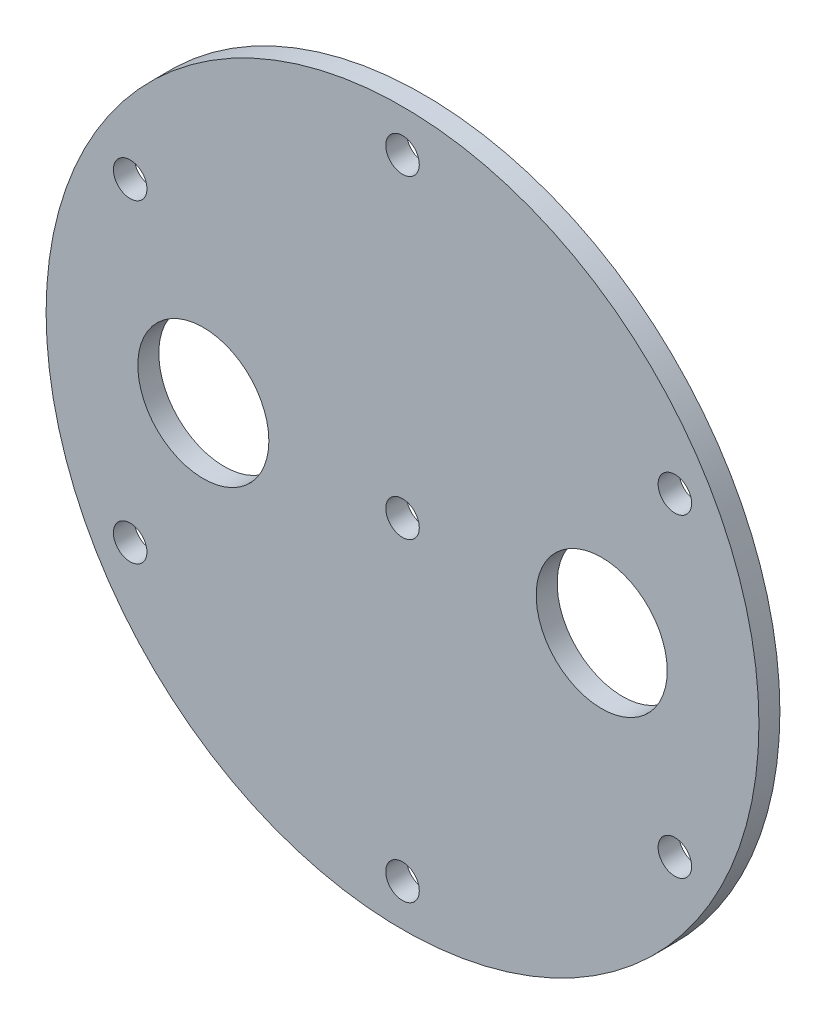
ISO-10303-21;
HEADER;
FILE_DESCRIPTION(('STEP AP214'),'2;1');
FILE_NAME('part.step','',(''),(''),'','','');
FILE_SCHEMA(('AUTOMOTIVE_DESIGN { 1 0 10303 214 1 1 1 1 }'));
ENDSEC;
DATA;
#1=APPLICATION_CONTEXT('core data for automotive mechanical design processes');
#2=APPLICATION_PROTOCOL_DEFINITION('international standard','automotive_design',2000,#1);
#3=PRODUCT_CONTEXT('',#1,'mechanical');
#4=PRODUCT('Part','Part','',(#3));
#5=PRODUCT_RELATED_PRODUCT_CATEGORY('part','',(#4));
#6=PRODUCT_DEFINITION_FORMATION('','',#4);
#7=PRODUCT_DEFINITION_CONTEXT('part definition',#1,'design');
#8=PRODUCT_DEFINITION('design','',#6,#7);
#9=PRODUCT_DEFINITION_SHAPE('','',#8);
#10=(LENGTH_UNIT() NAMED_UNIT(*) SI_UNIT(.MILLI.,.METRE.));
#11=(NAMED_UNIT(*) PLANE_ANGLE_UNIT() SI_UNIT($,.RADIAN.));
#12=(NAMED_UNIT(*) SI_UNIT($,.STERADIAN.) SOLID_ANGLE_UNIT());
#13=UNCERTAINTY_MEASURE_WITH_UNIT(LENGTH_MEASURE(1.E-05),#10,'distance_accuracy_value','');
#14=(GEOMETRIC_REPRESENTATION_CONTEXT(3) GLOBAL_UNCERTAINTY_ASSIGNED_CONTEXT((#13)) GLOBAL_UNIT_ASSIGNED_CONTEXT((#10,
#11,#12)) REPRESENTATION_CONTEXT('',''));
#15=CARTESIAN_POINT('',(0.,0.,0.));
#16=DIRECTION('',(0.,0.,1.));
#17=DIRECTION('',(1.,0.,0.));
#18=AXIS2_PLACEMENT_3D('',#15,#16,#17);
#19=CARTESIAN_POINT('',(0.,0.,-2.));
#20=DIRECTION('',(0.,0.,1.));
#21=DIRECTION('',(1.,0.,0.));
#22=AXIS2_PLACEMENT_3D('',#19,#20,#21);
#23=CYLINDRICAL_SURFACE('',#22,34.);
#24=CARTESIAN_POINT('',(0.,0.,-2.));
#25=DIRECTION('',(0.,0.,1.));
#26=DIRECTION('',(1.,0.,0.));
#27=AXIS2_PLACEMENT_3D('',#24,#25,#26);
#28=CIRCLE('',#27,34.);
#29=CARTESIAN_POINT('',(34.,0.,-2.));
#30=VERTEX_POINT('',#29);
#31=EDGE_CURVE('E10',#30,#30,#28,.T.);
#32=ORIENTED_EDGE('',*,*,#31,.T.);
#33=EDGE_LOOP('',(#32));
#34=FACE_BOUND('',#33,.T.);
#35=CARTESIAN_POINT('',(0.,0.,0.));
#36=DIRECTION('',(0.,0.,1.));
#37=DIRECTION('',(1.,0.,0.));
#38=AXIS2_PLACEMENT_3D('',#35,#36,#37);
#39=CIRCLE('',#38,34.);
#40=CARTESIAN_POINT('',(34.,0.,0.));
#41=VERTEX_POINT('',#40);
#42=EDGE_CURVE('E35',#41,#41,#39,.T.);
#43=ORIENTED_EDGE('',*,*,#42,.F.);
#44=EDGE_LOOP('',(#43));
#45=FACE_BOUND('',#44,.T.);
#46=ADVANCED_FACE('F32',(#34,#45),#23,.T.);
#47=CARTESIAN_POINT('',(0.,0.,-2.));
#48=DIRECTION('',(0.,0.,1.));
#49=DIRECTION('',(1.,0.,0.));
#50=AXIS2_PLACEMENT_3D('',#47,#48,#49);
#51=PLANE('',#50);
#52=CARTESIAN_POINT('',(19.,0.,-2.));
#53=DIRECTION('',(0.,0.,1.));
#54=DIRECTION('',(1.,0.,0.));
#55=AXIS2_PLACEMENT_3D('',#52,#53,#54);
#56=CIRCLE('',#55,6.25);
#57=CARTESIAN_POINT('',(25.25,0.,-2.));
#58=VERTEX_POINT('',#57);
#59=EDGE_CURVE('E89',#58,#58,#56,.T.);
#60=ORIENTED_EDGE('',*,*,#59,.T.);
#61=EDGE_LOOP('',(#60));
#62=FACE_BOUND('',#61,.T.);
#63=CARTESIAN_POINT('',(-19.,0.,-2.));
#64=DIRECTION('',(0.,0.,1.));
#65=DIRECTION('',(1.,0.,0.));
#66=AXIS2_PLACEMENT_3D('',#63,#64,#65);
#67=CIRCLE('',#66,6.25);
#68=CARTESIAN_POINT('',(-12.75,0.,-2.));
#69=VERTEX_POINT('',#68);
#70=EDGE_CURVE('E83',#69,#69,#67,.T.);
#71=ORIENTED_EDGE('',*,*,#70,.T.);
#72=EDGE_LOOP('',(#71));
#73=FACE_BOUND('',#72,.T.);
#74=CARTESIAN_POINT('',(0.,0.,-2.));
#75=DIRECTION('',(0.,0.,1.));
#76=DIRECTION('',(1.,0.,0.));
#77=AXIS2_PLACEMENT_3D('',#74,#75,#76);
#78=CIRCLE('',#77,1.6);
#79=CARTESIAN_POINT('',(1.6,0.,-2.));
#80=VERTEX_POINT('',#79);
#81=EDGE_CURVE('E79',#80,#80,#78,.T.);
#82=ORIENTED_EDGE('',*,*,#81,.T.);
#83=EDGE_LOOP('',(#82));
#84=FACE_BOUND('',#83,.T.);
#85=CARTESIAN_POINT('',(25.980762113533,15.0000000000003,-2.));
#86=DIRECTION('',(0.,0.,1.));
#87=DIRECTION('',(1.,0.,0.));
#88=AXIS2_PLACEMENT_3D('',#85,#86,#87);
#89=CIRCLE('',#88,1.6);
#90=CARTESIAN_POINT('',(27.580762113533,15.0000000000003,-2.));
#91=VERTEX_POINT('',#90);
#92=EDGE_CURVE('E73',#91,#91,#89,.T.);
#93=ORIENTED_EDGE('',*,*,#92,.T.);
#94=EDGE_LOOP('',(#93));
#95=FACE_BOUND('',#94,.T.);
#96=CARTESIAN_POINT('',(25.9807621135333,-14.9999999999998,-2.));
#97=DIRECTION('',(0.,0.,1.));
#98=DIRECTION('',(1.,0.,0.));
#99=AXIS2_PLACEMENT_3D('',#96,#97,#98);
#100=CIRCLE('',#99,1.6);
#101=CARTESIAN_POINT('',(27.5807621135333,-14.9999999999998,-2.));
#102=VERTEX_POINT('',#101);
#103=EDGE_CURVE('E67',#102,#102,#100,.T.);
#104=ORIENTED_EDGE('',*,*,#103,.T.);
#105=EDGE_LOOP('',(#104));
#106=FACE_BOUND('',#105,.T.);
#107=CARTESIAN_POINT('',(2.09489001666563E-13,-30.,-2.));
#108=DIRECTION('',(0.,0.,1.));
#109=DIRECTION('',(1.,0.,0.));
#110=AXIS2_PLACEMENT_3D('',#107,#108,#109);
#111=CIRCLE('',#110,1.6);
#112=CARTESIAN_POINT('',(1.60000000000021,-30.,-2.));
#113=VERTEX_POINT('',#112);
#114=EDGE_CURVE('E61',#113,#113,#111,.T.);
#115=ORIENTED_EDGE('',*,*,#114,.T.);
#116=EDGE_LOOP('',(#115));
#117=FACE_BOUND('',#116,.T.);
#118=CARTESIAN_POINT('',(-25.9807621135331,-15.0000000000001,-2.));
#119=DIRECTION('',(0.,0.,1.));
#120=DIRECTION('',(1.,0.,0.));
#121=AXIS2_PLACEMENT_3D('',#118,#119,#120);
#122=CIRCLE('',#121,1.6);
#123=CARTESIAN_POINT('',(-24.3807621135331,-15.0000000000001,-2.));
#124=VERTEX_POINT('',#123);
#125=EDGE_CURVE('E55',#124,#124,#122,.T.);
#126=ORIENTED_EDGE('',*,*,#125,.T.);
#127=EDGE_LOOP('',(#126));
#128=FACE_BOUND('',#127,.T.);
#129=CARTESIAN_POINT('',(-25.9807621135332,14.9999999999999,-2.));
#130=DIRECTION('',(0.,0.,1.));
#131=DIRECTION('',(1.,0.,0.));
#132=AXIS2_PLACEMENT_3D('',#129,#130,#131);
#133=CIRCLE('',#132,1.6);
#134=CARTESIAN_POINT('',(-24.3807621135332,14.9999999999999,-2.));
#135=VERTEX_POINT('',#134);
#136=EDGE_CURVE('E49',#135,#135,#133,.T.);
#137=ORIENTED_EDGE('',*,*,#136,.T.);
#138=EDGE_LOOP('',(#137));
#139=FACE_BOUND('',#138,.T.);
#140=CARTESIAN_POINT('',(0.,30.,-2.));
#141=DIRECTION('',(0.,0.,1.));
#142=DIRECTION('',(1.,0.,0.));
#143=AXIS2_PLACEMENT_3D('',#140,#141,#142);
#144=CIRCLE('',#143,1.6);
#145=CARTESIAN_POINT('',(1.6,30.,-2.));
#146=VERTEX_POINT('',#145);
#147=EDGE_CURVE('E42',#146,#146,#144,.T.);
#148=ORIENTED_EDGE('',*,*,#147,.T.);
#149=EDGE_LOOP('',(#148));
#150=FACE_BOUND('',#149,.T.);
#151=ORIENTED_EDGE('',*,*,#31,.F.);
#152=EDGE_LOOP('',(#151));
#153=FACE_BOUND('',#152,.T.);
#154=ADVANCED_FACE('F98',(#62,#73,#84,#95,#106,#117,#128,#139,#150,#153),#51,.F.);
#155=CARTESIAN_POINT('',(0.,0.,0.));
#156=DIRECTION('',(0.,0.,1.));
#157=DIRECTION('',(1.,0.,0.));
#158=AXIS2_PLACEMENT_3D('',#155,#156,#157);
#159=PLANE('',#158);
#160=CARTESIAN_POINT('',(19.,0.,0.));
#161=DIRECTION('',(0.,0.,1.));
#162=DIRECTION('',(1.,0.,0.));
#163=AXIS2_PLACEMENT_3D('',#160,#161,#162);
#164=CIRCLE('',#163,6.25);
#165=CARTESIAN_POINT('',(25.25,0.,0.));
#166=VERTEX_POINT('',#165);
#167=EDGE_CURVE('E92',#166,#166,#164,.T.);
#168=ORIENTED_EDGE('',*,*,#167,.F.);
#169=EDGE_LOOP('',(#168));
#170=FACE_BOUND('',#169,.T.);
#171=CARTESIAN_POINT('',(-19.,0.,0.));
#172=DIRECTION('',(0.,0.,1.));
#173=DIRECTION('',(1.,0.,0.));
#174=AXIS2_PLACEMENT_3D('',#171,#172,#173);
#175=CIRCLE('',#174,6.25);
#176=CARTESIAN_POINT('',(-12.75,0.,0.));
#177=VERTEX_POINT('',#176);
#178=EDGE_CURVE('E86',#177,#177,#175,.T.);
#179=ORIENTED_EDGE('',*,*,#178,.F.);
#180=EDGE_LOOP('',(#179));
#181=FACE_BOUND('',#180,.T.);
#182=CARTESIAN_POINT('',(0.,0.,0.));
#183=DIRECTION('',(0.,0.,1.));
#184=DIRECTION('',(1.,0.,0.));
#185=AXIS2_PLACEMENT_3D('',#182,#183,#184);
#186=CIRCLE('',#185,1.6);
#187=CARTESIAN_POINT('',(1.6,0.,0.));
#188=VERTEX_POINT('',#187);
#189=EDGE_CURVE('E80',#188,#188,#186,.T.);
#190=ORIENTED_EDGE('',*,*,#189,.F.);
#191=EDGE_LOOP('',(#190));
#192=FACE_BOUND('',#191,.T.);
#193=CARTESIAN_POINT('',(25.980762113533,15.0000000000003,0.));
#194=DIRECTION('',(0.,0.,1.));
#195=DIRECTION('',(1.,0.,0.));
#196=AXIS2_PLACEMENT_3D('',#193,#194,#195);
#197=CIRCLE('',#196,1.59999999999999);
#198=CARTESIAN_POINT('',(27.580762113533,15.0000000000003,0.));
#199=VERTEX_POINT('',#198);
#200=EDGE_CURVE('E76',#199,#199,#197,.T.);
#201=ORIENTED_EDGE('',*,*,#200,.F.);
#202=EDGE_LOOP('',(#201));
#203=FACE_BOUND('',#202,.T.);
#204=CARTESIAN_POINT('',(25.9807621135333,-14.9999999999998,0.));
#205=DIRECTION('',(0.,0.,1.));
#206=DIRECTION('',(1.,0.,0.));
#207=AXIS2_PLACEMENT_3D('',#204,#205,#206);
#208=CIRCLE('',#207,1.59999999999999);
#209=CARTESIAN_POINT('',(27.5807621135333,-14.9999999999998,0.));
#210=VERTEX_POINT('',#209);
#211=EDGE_CURVE('E70',#210,#210,#208,.T.);
#212=ORIENTED_EDGE('',*,*,#211,.F.);
#213=EDGE_LOOP('',(#212));
#214=FACE_BOUND('',#213,.T.);
#215=CARTESIAN_POINT('',(2.09489001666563E-13,-30.,0.));
#216=DIRECTION('',(0.,0.,1.));
#217=DIRECTION('',(1.,0.,0.));
#218=AXIS2_PLACEMENT_3D('',#215,#216,#217);
#219=CIRCLE('',#218,1.59999999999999);
#220=CARTESIAN_POINT('',(1.6000000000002,-30.,0.));
#221=VERTEX_POINT('',#220);
#222=EDGE_CURVE('E64',#221,#221,#219,.T.);
#223=ORIENTED_EDGE('',*,*,#222,.F.);
#224=EDGE_LOOP('',(#223));
#225=FACE_BOUND('',#224,.T.);
#226=CARTESIAN_POINT('',(-25.9807621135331,-15.0000000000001,0.));
#227=DIRECTION('',(0.,0.,1.));
#228=DIRECTION('',(1.,0.,0.));
#229=AXIS2_PLACEMENT_3D('',#226,#227,#228);
#230=CIRCLE('',#229,1.59999999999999);
#231=CARTESIAN_POINT('',(-24.3807621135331,-15.0000000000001,0.));
#232=VERTEX_POINT('',#231);
#233=EDGE_CURVE('E58',#232,#232,#230,.T.);
#234=ORIENTED_EDGE('',*,*,#233,.F.);
#235=EDGE_LOOP('',(#234));
#236=FACE_BOUND('',#235,.T.);
#237=CARTESIAN_POINT('',(-25.9807621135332,14.9999999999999,0.));
#238=DIRECTION('',(0.,0.,1.));
#239=DIRECTION('',(1.,0.,0.));
#240=AXIS2_PLACEMENT_3D('',#237,#238,#239);
#241=CIRCLE('',#240,1.59999999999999);
#242=CARTESIAN_POINT('',(-24.3807621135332,14.9999999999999,0.));
#243=VERTEX_POINT('',#242);
#244=EDGE_CURVE('E52',#243,#243,#241,.T.);
#245=ORIENTED_EDGE('',*,*,#244,.F.);
#246=EDGE_LOOP('',(#245));
#247=FACE_BOUND('',#246,.T.);
#248=CARTESIAN_POINT('',(0.,30.,0.));
#249=DIRECTION('',(0.,0.,1.));
#250=DIRECTION('',(1.,0.,0.));
#251=AXIS2_PLACEMENT_3D('',#248,#249,#250);
#252=CIRCLE('',#251,1.59999999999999);
#253=CARTESIAN_POINT('',(1.59999999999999,30.,0.));
#254=VERTEX_POINT('',#253);
#255=EDGE_CURVE('E46',#254,#254,#252,.T.);
#256=ORIENTED_EDGE('',*,*,#255,.F.);
#257=EDGE_LOOP('',(#256));
#258=FACE_BOUND('',#257,.T.);
#259=ORIENTED_EDGE('',*,*,#42,.T.);
#260=EDGE_LOOP('',(#259));
#261=FACE_BOUND('',#260,.T.);
#262=ADVANCED_FACE('F108',(#170,#181,#192,#203,#214,#225,#236,#247,#258,#261),#159,.T.);
#263=CARTESIAN_POINT('',(0.,30.,0.));
#264=DIRECTION('',(0.,0.,1.));
#265=DIRECTION('',(1.,0.,0.));
#266=AXIS2_PLACEMENT_3D('',#263,#264,#265);
#267=CYLINDRICAL_SURFACE('',#266,1.59999999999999);
#268=ORIENTED_EDGE('',*,*,#147,.F.);
#269=EDGE_LOOP('',(#268));
#270=FACE_BOUND('',#269,.T.);
#271=ORIENTED_EDGE('',*,*,#255,.T.);
#272=EDGE_LOOP('',(#271));
#273=FACE_BOUND('',#272,.T.);
#274=ADVANCED_FACE('F111',(#270,#273),#267,.F.);
#275=CARTESIAN_POINT('',(-25.9807621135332,14.9999999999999,0.));
#276=DIRECTION('',(0.,0.,1.));
#277=DIRECTION('',(1.,0.,0.));
#278=AXIS2_PLACEMENT_3D('',#275,#276,#277);
#279=CYLINDRICAL_SURFACE('',#278,1.59999999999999);
#280=ORIENTED_EDGE('',*,*,#136,.F.);
#281=EDGE_LOOP('',(#280));
#282=FACE_BOUND('',#281,.T.);
#283=ORIENTED_EDGE('',*,*,#244,.T.);
#284=EDGE_LOOP('',(#283));
#285=FACE_BOUND('',#284,.T.);
#286=ADVANCED_FACE('F140',(#282,#285),#279,.F.);
#287=CARTESIAN_POINT('',(-25.9807621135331,-15.0000000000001,0.));
#288=DIRECTION('',(0.,0.,1.));
#289=DIRECTION('',(1.,0.,0.));
#290=AXIS2_PLACEMENT_3D('',#287,#288,#289);
#291=CYLINDRICAL_SURFACE('',#290,1.59999999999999);
#292=ORIENTED_EDGE('',*,*,#125,.F.);
#293=EDGE_LOOP('',(#292));
#294=FACE_BOUND('',#293,.T.);
#295=ORIENTED_EDGE('',*,*,#233,.T.);
#296=EDGE_LOOP('',(#295));
#297=FACE_BOUND('',#296,.T.);
#298=ADVANCED_FACE('F144',(#294,#297),#291,.F.);
#299=CARTESIAN_POINT('',(2.09489001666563E-13,-30.,0.));
#300=DIRECTION('',(0.,0.,1.));
#301=DIRECTION('',(1.,0.,0.));
#302=AXIS2_PLACEMENT_3D('',#299,#300,#301);
#303=CYLINDRICAL_SURFACE('',#302,1.59999999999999);
#304=ORIENTED_EDGE('',*,*,#114,.F.);
#305=EDGE_LOOP('',(#304));
#306=FACE_BOUND('',#305,.T.);
#307=ORIENTED_EDGE('',*,*,#222,.T.);
#308=EDGE_LOOP('',(#307));
#309=FACE_BOUND('',#308,.T.);
#310=ADVANCED_FACE('F148',(#306,#309),#303,.F.);
#311=CARTESIAN_POINT('',(25.9807621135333,-14.9999999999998,0.));
#312=DIRECTION('',(0.,0.,1.));
#313=DIRECTION('',(1.,0.,0.));
#314=AXIS2_PLACEMENT_3D('',#311,#312,#313);
#315=CYLINDRICAL_SURFACE('',#314,1.59999999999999);
#316=ORIENTED_EDGE('',*,*,#103,.F.);
#317=EDGE_LOOP('',(#316));
#318=FACE_BOUND('',#317,.T.);
#319=ORIENTED_EDGE('',*,*,#211,.T.);
#320=EDGE_LOOP('',(#319));
#321=FACE_BOUND('',#320,.T.);
#322=ADVANCED_FACE('F152',(#318,#321),#315,.F.);
#323=CARTESIAN_POINT('',(25.980762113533,15.0000000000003,0.));
#324=DIRECTION('',(0.,0.,1.));
#325=DIRECTION('',(1.,0.,0.));
#326=AXIS2_PLACEMENT_3D('',#323,#324,#325);
#327=CYLINDRICAL_SURFACE('',#326,1.59999999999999);
#328=ORIENTED_EDGE('',*,*,#92,.F.);
#329=EDGE_LOOP('',(#328));
#330=FACE_BOUND('',#329,.T.);
#331=ORIENTED_EDGE('',*,*,#200,.T.);
#332=EDGE_LOOP('',(#331));
#333=FACE_BOUND('',#332,.T.);
#334=ADVANCED_FACE('F156',(#330,#333),#327,.F.);
#335=CARTESIAN_POINT('',(0.,0.,-2.));
#336=DIRECTION('',(0.,0.,1.));
#337=DIRECTION('',(1.,0.,0.));
#338=AXIS2_PLACEMENT_3D('',#335,#336,#337);
#339=CYLINDRICAL_SURFACE('',#338,1.6);
#340=ORIENTED_EDGE('',*,*,#81,.F.);
#341=EDGE_LOOP('',(#340));
#342=FACE_BOUND('',#341,.T.);
#343=ORIENTED_EDGE('',*,*,#189,.T.);
#344=EDGE_LOOP('',(#343));
#345=FACE_BOUND('',#344,.T.);
#346=ADVANCED_FACE('F160',(#342,#345),#339,.F.);
#347=CARTESIAN_POINT('',(-19.,0.,-2.));
#348=DIRECTION('',(0.,0.,1.));
#349=DIRECTION('',(1.,0.,0.));
#350=AXIS2_PLACEMENT_3D('',#347,#348,#349);
#351=CYLINDRICAL_SURFACE('',#350,6.25);
#352=ORIENTED_EDGE('',*,*,#70,.F.);
#353=EDGE_LOOP('',(#352));
#354=FACE_BOUND('',#353,.T.);
#355=ORIENTED_EDGE('',*,*,#178,.T.);
#356=EDGE_LOOP('',(#355));
#357=FACE_BOUND('',#356,.T.);
#358=ADVANCED_FACE('F104',(#354,#357),#351,.F.);
#359=CARTESIAN_POINT('',(19.,0.,-2.));
#360=DIRECTION('',(0.,0.,1.));
#361=DIRECTION('',(1.,0.,0.));
#362=AXIS2_PLACEMENT_3D('',#359,#360,#361);
#363=CYLINDRICAL_SURFACE('',#362,6.25);
#364=ORIENTED_EDGE('',*,*,#59,.F.);
#365=EDGE_LOOP('',(#364));
#366=FACE_BOUND('',#365,.T.);
#367=ORIENTED_EDGE('',*,*,#167,.T.);
#368=EDGE_LOOP('',(#367));
#369=FACE_BOUND('',#368,.T.);
#370=ADVANCED_FACE('F101',(#366,#369),#363,.F.);
#371=CLOSED_SHELL('',(#46,#154,#262,#274,#286,#298,#310,#322,#334,#346,#358,#370));
#372=MANIFOLD_SOLID_BREP('B2',#371);
#373=ADVANCED_BREP_SHAPE_REPRESENTATION('',(#18,#372),#14);
#374=SHAPE_DEFINITION_REPRESENTATION(#9,#373);
ENDSEC;
END-ISO-10303-21;
